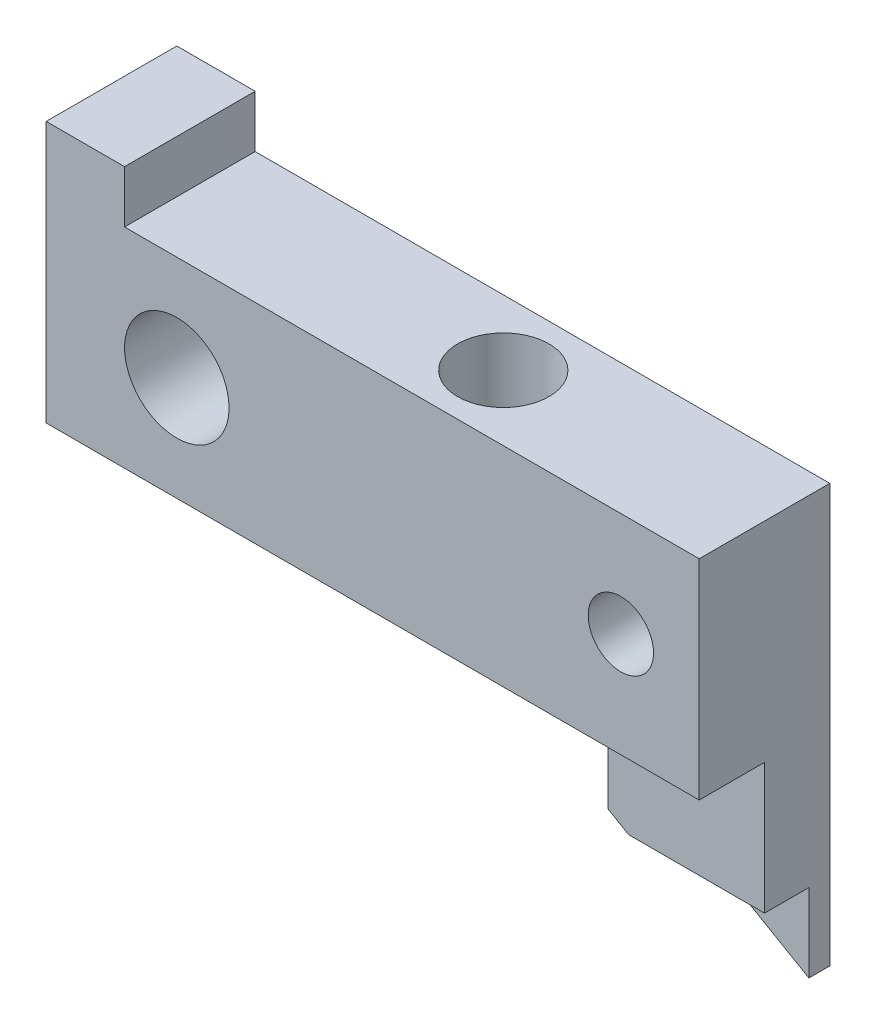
from build123d import *

# Parameters (mm, degrees)
SKETCH_2_R          = 2
EXTRUDE_1_DEPTH     = 5
SKETCH_3_OUTSIDE_W  = 13.242
SKETCH_3_OUTSIDE_H  = 26.242
CUT_EXTRUDE_1_DEPTH = 32.208973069
SKETCH_4_R          = 1.25
CUT_EXTRUDE_2_DEPTH = 5
SKETCH_5_R          = 1.75
CUT_EXTRUDE_3_DEPTH = 3


with BuildPart() as part:
    # Sketch 2 → Extrude 1 (new body)
    with BuildSketch(Plane.XY):
        Polygon((19, 3.464101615), (25, 0), (25, 16), (3, 16), (3, 18), (0, 18), (0, 8), (19, 8), align=None)
        with Locations((5, 12)):
            Circle(SKETCH_2_R, mode=Mode.SUBTRACT)
    extrude(amount=EXTRUDE_1_DEPTH)

    # Sketch 3 outside → Cut-Extrude 1 (cut, through all)
    with BuildSketch(Plane(origin=(25, 0, 0), x_dir=(0, 0, -1), z_dir=(1, 0, 0))):
        with Locations((-2.5, 9)):
            Rectangle(SKETCH_3_OUTSIDE_W, SKETCH_3_OUTSIDE_H)
        Polygon((-0.8, 0), (0, 0), (0, 18), (-5, 18), (-5, 8), (-2.5, 8), (-2.5, 3), (-0.8, 3), align=None, mode=Mode.SUBTRACT)
    extrude(amount=-CUT_EXTRUDE_1_DEPTH, mode=Mode.SUBTRACT)

    # Sketch 4 → Cut-Extrude 2 (cut)
    with BuildSketch(Plane.XY.offset(5)):
        with Locations((22, 12)):
            Circle(SKETCH_4_R)
    extrude(amount=-CUT_EXTRUDE_2_DEPTH, mode=Mode.SUBTRACT)

    # Sketch 5 → Cut-Extrude 3 (cut)
    with BuildSketch(Plane(origin=(0, 16, 0), x_dir=(1, 0, 0), z_dir=(0, 1, 0))):
        with Locations(Location((15, -2.5, 0), (0, 0, 270))):
            Circle(SKETCH_5_R)
    extrude(amount=-CUT_EXTRUDE_3_DEPTH, mode=Mode.SUBTRACT)


solid = part.part
